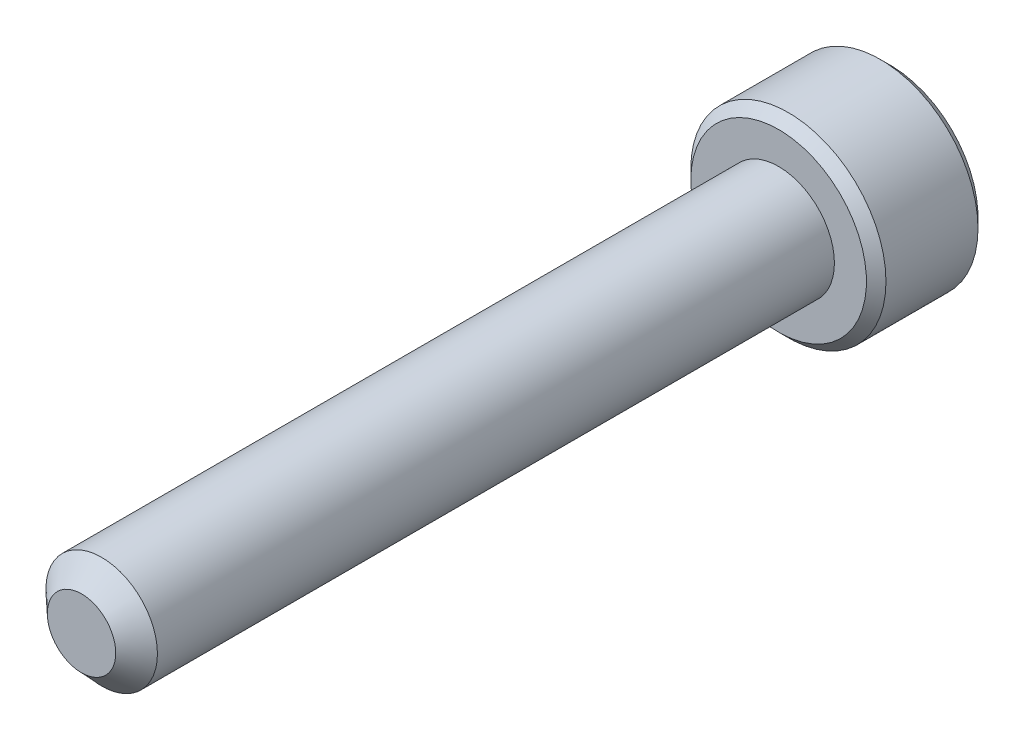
from build123d import *

# Parameters (mm, degrees)
SKETCH1_R          = 2
EXTRUDE1_DEPTH     = 25
SKETCH6_R          = 3.5
EXTRUDE2_DEPTH     = 4
CUT_EXTRUDE1_DEPTH = 2.25
CHAMFER1_SIZE      = 0.35


with BuildPart() as part:
    # Sketch1 → Extrude1 (new body)
    with BuildSketch(Plane.XY):
        Circle(SKETCH1_R)
    extrude(amount=-EXTRUDE1_DEPTH)

    # Sketch4 → Cut-Revolve1 (revolve, cut)
    with BuildSketch(Plane(origin=(0, 0, 0), x_dir=(0, 0, -1), z_dir=(1, 0, 0)), mode=Mode.PRIVATE) as cut_revolve1_sk:
        Polygon((0.721407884, 2), (0, 1.226384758), (0, 2), align=None)
    revolve(cut_revolve1_sk.sketch.rotate(Axis((0, 0, 0), (0, 0, -1)), 90), axis=Axis((0, 0, 0), (0, 0, -1)), mode=Mode.SUBTRACT)

    # Sketch6 → Extrude2 (add)
    with BuildSketch(Plane(origin=(0, 0, -25), x_dir=(-1, 0, 0), z_dir=(0, 0, -1))):
        Circle(SKETCH6_R)
    extrude(amount=EXTRUDE2_DEPTH)

    # Sketch7 → Cut-Extrude1 (cut)
    with BuildSketch(Plane(origin=(0, 0, -29), x_dir=(-1, 0, 0), z_dir=(0, 0, -1))):
        Polygon((0, 1.732050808), (-1.5, 0.866025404), (-1.5, -0.866025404), (0, -1.732050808), (1.5, -0.866025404), (1.5, 0.866025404), align=None)
    extrude(amount=-CUT_EXTRUDE1_DEPTH, mode=Mode.SUBTRACT)

    # Cut-Extrude2 cone 1 section (on through the dimple's axis) → Cut-Extrude2 (revolve, cut)
    with BuildSketch(Plane(origin=(0, 0, -29), x_dir=(0, 1, 0), z_dir=(1, 0, 0))):
        Polygon((0, 0), (1.732050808, 0), (0, 1.732050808), align=None)
    revolve(axis=Axis((0, 0, -29), (0, 0, 1)), mode=Mode.SUBTRACT)

    # Chamfer1
    chamfer1_edges = [part.edges().sort_by_distance(p)[0] for p in [
        (3.5, 0, -25),
        (3.5, 0, -29),
    ]]
    chamfer(chamfer1_edges, length=CHAMFER1_SIZE)


solid = part.part
